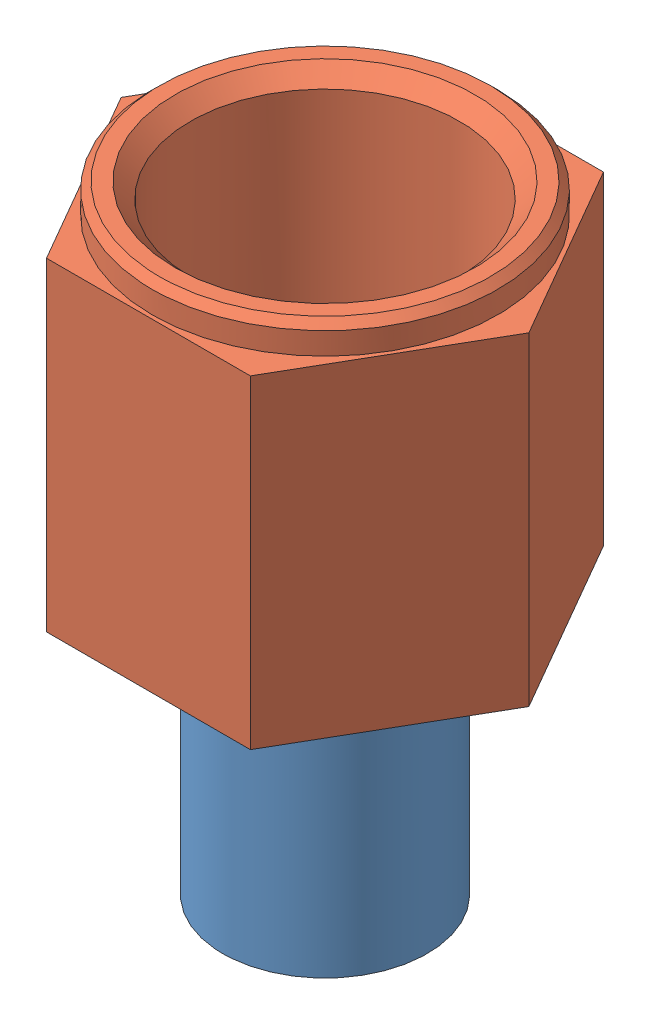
SolidWorks assembly Sestava5.sldasm, configuration Výchozí (file format 4700). Lengths in mm.
Overall size (27.71 42 24).
2 component instances, 2 part files, 2 mates.
Components (placement in the parent):
- Koncovka 32-1: Koncovka 32.SLDPRT [Výchozí] at origin size (17.8 26 17.8)
- Matice 32-1: Matice 32.SLDPRT [Výchozí] at (0 18 0) size (27.71 24 24)
Mates (geometry in assembly coordinates):
- Soustředná1: concentric: cylinder of Koncovka 32-1 through (0 22 0) axis (0 -1 0) radius 6.95; cylinder of Matice 32-1 through (0 42 0) axis (0 1 0) radius 7
- Sjednocená1: coincident anti-aligned: plane of Koncovka 32-1 through (0 22 0) normal (0 -1 0); plane of Matice 32-1 through (0 22 7.5) normal (0 1 0)
